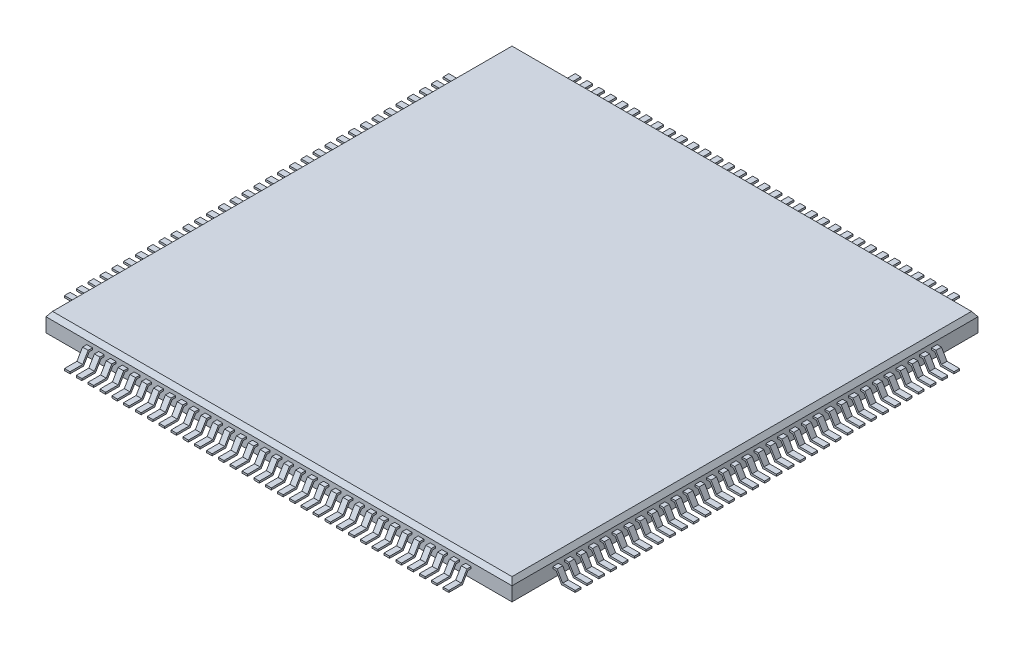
from build123d import *
from OCP.BRepFilletAPI import BRepFilletAPI_MakeChamfer

# Parameters (mm, degrees)
SKETCH1_W             = 25
SKETCH1_H             = 25
EXTRUDE1_DEPTH        = 0.5
CHAMFER1_SIZE         = 0.25
CHAMFER1_SIZE2        = 0.175051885
EXTRUDE_THIN1_DEPTH   = 0.15
LPATTERN1_COUNT       = 17
LPATTERN1_PITCH       = 0.635
LPATTERN1_COL_COUNT   = 17
LPATTERN1_COL_PITCH   = 0.635
MIRROR1_COPY_1_DEPTH  = 0.15
MIRROR1_COPY_2_DEPTH  = 0.15
MIRROR1_COPY_3_DEPTH  = 0.15
MIRROR1_COPY_4_DEPTH  = 0.15
MIRROR1_COPY_5_DEPTH  = 0.15
MIRROR1_COPY_6_DEPTH  = 0.15
MIRROR1_COPY_7_DEPTH  = 0.15
MIRROR1_COPY_8_DEPTH  = 0.15
MIRROR1_COPY_9_DEPTH  = 0.15
MIRROR1_COPY_10_DEPTH = 0.15
MIRROR1_COPY_11_DEPTH = 0.15
MIRROR1_COPY_12_DEPTH = 0.15
MIRROR1_COPY_13_DEPTH = 0.15
MIRROR1_COPY_14_DEPTH = 0.15
MIRROR1_COPY_15_DEPTH = 0.15
MIRROR1_COPY_16_DEPTH = 0.15
MIRROR1_COPY_17_DEPTH = 0.15
MIRROR1_COPY_18_DEPTH = 0.15
MIRROR1_COPY_19_DEPTH = 0.15
MIRROR1_COPY_20_DEPTH = 0.15
MIRROR1_COPY_21_DEPTH = 0.15
MIRROR1_COPY_22_DEPTH = 0.15
MIRROR1_COPY_23_DEPTH = 0.15
MIRROR1_COPY_24_DEPTH = 0.15
MIRROR1_COPY_25_DEPTH = 0.15
MIRROR1_COPY_26_DEPTH = 0.15
MIRROR1_COPY_27_DEPTH = 0.15
MIRROR1_COPY_28_DEPTH = 0.15
MIRROR1_COPY_29_DEPTH = 0.15
MIRROR1_COPY_30_DEPTH = 0.15
MIRROR1_COPY_31_DEPTH = 0.15
MIRROR1_COPY_32_DEPTH = 0.15
BODY_MOVE_COPY1_ANGLE = 90


with BuildPart() as part:
    # Sketch1 → Extrude1 (new, symmetric)
    with BuildSketch(Plane(origin=(0, 0, 0), x_dir=(1, 0, 0), z_dir=(0, 1, 0))):
        Rectangle(SKETCH1_W, SKETCH1_H)
    extrude(amount=EXTRUDE1_DEPTH, both=True)

    # Chamfer1: one chamfer whose edges measure the first distance from different faces: ONE call of the kernel's chamfer builder (chamfer() names one face for all edges)
    chamfer1_edges_1 = [part.edges().sort_by_distance(p)[0] for p in [
        (12.5, 0.5, 0),
    ]]
    chamfer1_side_1 = [part.faces().sort_by_distance(p)[0] for p in [
        (12.5, 0, 0),
    ]]
    chamfer1_edges_2 = [part.edges().sort_by_distance(p)[0] for p in [
        (0, 0.5, -12.5),
    ]]
    chamfer1_side_2 = [part.faces().sort_by_distance(p)[0] for p in [
        (0, 0, -12.5),
    ]]
    chamfer1_edges_3 = [part.edges().sort_by_distance(p)[0] for p in [
        (-12.5, 0.5, 0),
    ]]
    chamfer1_side_3 = [part.faces().sort_by_distance(p)[0] for p in [
        (-12.5, 0, 0),
    ]]
    chamfer1_edges_4 = [part.edges().sort_by_distance(p)[0] for p in [
        (0, 0.5, 12.5),
    ]]
    chamfer1_side_4 = [part.faces().sort_by_distance(p)[0] for p in [
        (0, 0, 12.5),
    ]]
    chamfer1 = BRepFilletAPI_MakeChamfer(part.part.solid().wrapped)
    for e in chamfer1_edges_1:
        chamfer1.Add(CHAMFER1_SIZE, CHAMFER1_SIZE2, e.wrapped, chamfer1_side_1[0].wrapped)  # the first distance lies on this face
    for e in chamfer1_edges_2:
        chamfer1.Add(CHAMFER1_SIZE, CHAMFER1_SIZE2, e.wrapped, chamfer1_side_2[0].wrapped)  # the first distance lies on this face
    for e in chamfer1_edges_3:
        chamfer1.Add(CHAMFER1_SIZE, CHAMFER1_SIZE2, e.wrapped, chamfer1_side_3[0].wrapped)  # the first distance lies on this face
    for e in chamfer1_edges_4:
        chamfer1.Add(CHAMFER1_SIZE, CHAMFER1_SIZE2, e.wrapped, chamfer1_side_4[0].wrapped)  # the first distance lies on this face
    add(Compound.cast(chamfer1.Shape()), mode=Mode.REPLACE)

    # Sketch4 → Extrude-Thin1 (add, symmetric)
    with BuildSketch(Plane.XY):
        Polygon((-12.5, 0.05), (-12.728597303, 0.05), (-13.028597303, -0.46), (-13.7, -0.46), (-13.7, -0.56), (-12.971402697, -0.56), (-12.671402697, -0.05), (-12.5, -0.05), align=None)
    extrude_thin1 = extrude(amount=EXTRUDE_THIN1_DEPTH, both=True)

    # LPattern1: Extrude-Thin1 ×17
    with Locations(*[(0, 0, -i * LPATTERN1_PITCH) for i in range(1, LPATTERN1_COUNT)]):
        add(extrude_thin1)

    # LPattern1 col: Extrude-Thin1 ×17
    with Locations(*[(0, 0, i * LPATTERN1_COL_PITCH) for i in range(1, LPATTERN1_COL_COUNT)]):
        add(extrude_thin1)

    # Mirror1: Extrude-Thin1 across plane
    add(extrude_thin1.mirror(Plane(origin=(0, 0, 0), x_dir=(0, 0, 1), z_dir=(1, 0, 0))))

    # Mirror1 copy 1 sketch → Mirror1 copy 1 (add, symmetric)
    with BuildSketch(Plane(origin=(0, 0, -0.635), x_dir=(-1, 0, 0), z_dir=(0, 0, 1))):
        Polygon((-12.5, -0.05), (-12.728597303, -0.05), (-13.028597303, 0.46), (-13.7, 0.46), (-13.7, 0.56), (-12.971402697, 0.56), (-12.671402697, 0.05), (-12.5, 0.05), align=None)
    extrude(amount=MIRROR1_COPY_1_DEPTH, both=True)

    # Mirror1 copy 2 sketch → Mirror1 copy 2 (add, symmetric)
    with BuildSketch(Plane(origin=(0, 0, -1.27), x_dir=(-1, 0, 0), z_dir=(0, 0, 1))):
        Polygon((-12.5, -0.05), (-12.728597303, -0.05), (-13.028597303, 0.46), (-13.7, 0.46), (-13.7, 0.56), (-12.971402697, 0.56), (-12.671402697, 0.05), (-12.5, 0.05), align=None)
    extrude(amount=MIRROR1_COPY_2_DEPTH, both=True)

    # Mirror1 copy 3 sketch → Mirror1 copy 3 (add, symmetric)
    with BuildSketch(Plane(origin=(0, 0, -1.905), x_dir=(-1, 0, 0), z_dir=(0, 0, 1))):
        Polygon((-12.5, -0.05), (-12.728597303, -0.05), (-13.028597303, 0.46), (-13.7, 0.46), (-13.7, 0.56), (-12.971402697, 0.56), (-12.671402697, 0.05), (-12.5, 0.05), align=None)
    extrude(amount=MIRROR1_COPY_3_DEPTH, both=True)

    # Mirror1 copy 4 sketch → Mirror1 copy 4 (add, symmetric)
    with BuildSketch(Plane(origin=(0, 0, -2.54), x_dir=(-1, 0, 0), z_dir=(0, 0, 1))):
        Polygon((-12.5, -0.05), (-12.728597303, -0.05), (-13.028597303, 0.46), (-13.7, 0.46), (-13.7, 0.56), (-12.971402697, 0.56), (-12.671402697, 0.05), (-12.5, 0.05), align=None)
    extrude(amount=MIRROR1_COPY_4_DEPTH, both=True)

    # Mirror1 copy 5 sketch → Mirror1 copy 5 (add, symmetric)
    with BuildSketch(Plane(origin=(0, 0, -3.175), x_dir=(-1, 0, 0), z_dir=(0, 0, 1))):
        Polygon((-12.5, -0.05), (-12.728597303, -0.05), (-13.028597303, 0.46), (-13.7, 0.46), (-13.7, 0.56), (-12.971402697, 0.56), (-12.671402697, 0.05), (-12.5, 0.05), align=None)
    extrude(amount=MIRROR1_COPY_5_DEPTH, both=True)

    # Mirror1 copy 6 sketch → Mirror1 copy 6 (add, symmetric)
    with BuildSketch(Plane(origin=(0, 0, -3.81), x_dir=(-1, 0, 0), z_dir=(0, 0, 1))):
        Polygon((-12.5, -0.05), (-12.728597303, -0.05), (-13.028597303, 0.46), (-13.7, 0.46), (-13.7, 0.56), (-12.971402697, 0.56), (-12.671402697, 0.05), (-12.5, 0.05), align=None)
    extrude(amount=MIRROR1_COPY_6_DEPTH, both=True)

    # Mirror1 copy 7 sketch → Mirror1 copy 7 (add, symmetric)
    with BuildSketch(Plane(origin=(0, 0, -4.445), x_dir=(-1, 0, 0), z_dir=(0, 0, 1))):
        Polygon((-12.5, -0.05), (-12.728597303, -0.05), (-13.028597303, 0.46), (-13.7, 0.46), (-13.7, 0.56), (-12.971402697, 0.56), (-12.671402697, 0.05), (-12.5, 0.05), align=None)
    extrude(amount=MIRROR1_COPY_7_DEPTH, both=True)

    # Mirror1 copy 8 sketch → Mirror1 copy 8 (add, symmetric)
    with BuildSketch(Plane(origin=(0, 0, -5.08), x_dir=(-1, 0, 0), z_dir=(0, 0, 1))):
        Polygon((-12.5, -0.05), (-12.728597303, -0.05), (-13.028597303, 0.46), (-13.7, 0.46), (-13.7, 0.56), (-12.971402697, 0.56), (-12.671402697, 0.05), (-12.5, 0.05), align=None)
    extrude(amount=MIRROR1_COPY_8_DEPTH, both=True)

    # Mirror1 copy 9 sketch → Mirror1 copy 9 (add, symmetric)
    with BuildSketch(Plane(origin=(0, 0, -5.715), x_dir=(-1, 0, 0), z_dir=(0, 0, 1))):
        Polygon((-12.5, -0.05), (-12.728597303, -0.05), (-13.028597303, 0.46), (-13.7, 0.46), (-13.7, 0.56), (-12.971402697, 0.56), (-12.671402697, 0.05), (-12.5, 0.05), align=None)
    extrude(amount=MIRROR1_COPY_9_DEPTH, both=True)

    # Mirror1 copy 10 sketch → Mirror1 copy 10 (add, symmetric)
    with BuildSketch(Plane(origin=(0, 0, -6.35), x_dir=(-1, 0, 0), z_dir=(0, 0, 1))):
        Polygon((-12.5, -0.05), (-12.728597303, -0.05), (-13.028597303, 0.46), (-13.7, 0.46), (-13.7, 0.56), (-12.971402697, 0.56), (-12.671402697, 0.05), (-12.5, 0.05), align=None)
    extrude(amount=MIRROR1_COPY_10_DEPTH, both=True)

    # Mirror1 copy 11 sketch → Mirror1 copy 11 (add, symmetric)
    with BuildSketch(Plane(origin=(0, 0, -6.985), x_dir=(-1, 0, 0), z_dir=(0, 0, 1))):
        Polygon((-12.5, -0.05), (-12.728597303, -0.05), (-13.028597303, 0.46), (-13.7, 0.46), (-13.7, 0.56), (-12.971402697, 0.56), (-12.671402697, 0.05), (-12.5, 0.05), align=None)
    extrude(amount=MIRROR1_COPY_11_DEPTH, both=True)

    # Mirror1 copy 12 sketch → Mirror1 copy 12 (add, symmetric)
    with BuildSketch(Plane(origin=(0, 0, -7.62), x_dir=(-1, 0, 0), z_dir=(0, 0, 1))):
        Polygon((-12.5, -0.05), (-12.728597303, -0.05), (-13.028597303, 0.46), (-13.7, 0.46), (-13.7, 0.56), (-12.971402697, 0.56), (-12.671402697, 0.05), (-12.5, 0.05), align=None)
    extrude(amount=MIRROR1_COPY_12_DEPTH, both=True)

    # Mirror1 copy 13 sketch → Mirror1 copy 13 (add, symmetric)
    with BuildSketch(Plane(origin=(0, 0, -8.255), x_dir=(-1, 0, 0), z_dir=(0, 0, 1))):
        Polygon((-12.5, -0.05), (-12.728597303, -0.05), (-13.028597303, 0.46), (-13.7, 0.46), (-13.7, 0.56), (-12.971402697, 0.56), (-12.671402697, 0.05), (-12.5, 0.05), align=None)
    extrude(amount=MIRROR1_COPY_13_DEPTH, both=True)

    # Mirror1 copy 14 sketch → Mirror1 copy 14 (add, symmetric)
    with BuildSketch(Plane(origin=(0, 0, -8.89), x_dir=(-1, 0, 0), z_dir=(0, 0, 1))):
        Polygon((-12.5, -0.05), (-12.728597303, -0.05), (-13.028597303, 0.46), (-13.7, 0.46), (-13.7, 0.56), (-12.971402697, 0.56), (-12.671402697, 0.05), (-12.5, 0.05), align=None)
    extrude(amount=MIRROR1_COPY_14_DEPTH, both=True)

    # Mirror1 copy 15 sketch → Mirror1 copy 15 (add, symmetric)
    with BuildSketch(Plane(origin=(0, 0, -9.525), x_dir=(-1, 0, 0), z_dir=(0, 0, 1))):
        Polygon((-12.5, -0.05), (-12.728597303, -0.05), (-13.028597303, 0.46), (-13.7, 0.46), (-13.7, 0.56), (-12.971402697, 0.56), (-12.671402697, 0.05), (-12.5, 0.05), align=None)
    extrude(amount=MIRROR1_COPY_15_DEPTH, both=True)

    # Mirror1 copy 16 sketch → Mirror1 copy 16 (add, symmetric)
    with BuildSketch(Plane(origin=(0, 0, -10.16), x_dir=(-1, 0, 0), z_dir=(0, 0, 1))):
        Polygon((-12.5, -0.05), (-12.728597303, -0.05), (-13.028597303, 0.46), (-13.7, 0.46), (-13.7, 0.56), (-12.971402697, 0.56), (-12.671402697, 0.05), (-12.5, 0.05), align=None)
    extrude(amount=MIRROR1_COPY_16_DEPTH, both=True)

    # Mirror1 copy 17 sketch → Mirror1 copy 17 (add, symmetric)
    with BuildSketch(Plane(origin=(0, 0, 0.635), x_dir=(-1, 0, 0), z_dir=(0, 0, 1))):
        Polygon((-12.5, -0.05), (-12.728597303, -0.05), (-13.028597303, 0.46), (-13.7, 0.46), (-13.7, 0.56), (-12.971402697, 0.56), (-12.671402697, 0.05), (-12.5, 0.05), align=None)
    extrude(amount=MIRROR1_COPY_17_DEPTH, both=True)

    # Mirror1 copy 18 sketch → Mirror1 copy 18 (add, symmetric)
    with BuildSketch(Plane(origin=(0, 0, 1.27), x_dir=(-1, 0, 0), z_dir=(0, 0, 1))):
        Polygon((-12.5, -0.05), (-12.728597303, -0.05), (-13.028597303, 0.46), (-13.7, 0.46), (-13.7, 0.56), (-12.971402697, 0.56), (-12.671402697, 0.05), (-12.5, 0.05), align=None)
    extrude(amount=MIRROR1_COPY_18_DEPTH, both=True)

    # Mirror1 copy 19 sketch → Mirror1 copy 19 (add, symmetric)
    with BuildSketch(Plane(origin=(0, 0, 1.905), x_dir=(-1, 0, 0), z_dir=(0, 0, 1))):
        Polygon((-12.5, -0.05), (-12.728597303, -0.05), (-13.028597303, 0.46), (-13.7, 0.46), (-13.7, 0.56), (-12.971402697, 0.56), (-12.671402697, 0.05), (-12.5, 0.05), align=None)
    extrude(amount=MIRROR1_COPY_19_DEPTH, both=True)

    # Mirror1 copy 20 sketch → Mirror1 copy 20 (add, symmetric)
    with BuildSketch(Plane(origin=(0, 0, 2.54), x_dir=(-1, 0, 0), z_dir=(0, 0, 1))):
        Polygon((-12.5, -0.05), (-12.728597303, -0.05), (-13.028597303, 0.46), (-13.7, 0.46), (-13.7, 0.56), (-12.971402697, 0.56), (-12.671402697, 0.05), (-12.5, 0.05), align=None)
    extrude(amount=MIRROR1_COPY_20_DEPTH, both=True)

    # Mirror1 copy 21 sketch → Mirror1 copy 21 (add, symmetric)
    with BuildSketch(Plane(origin=(0, 0, 3.175), x_dir=(-1, 0, 0), z_dir=(0, 0, 1))):
        Polygon((-12.5, -0.05), (-12.728597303, -0.05), (-13.028597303, 0.46), (-13.7, 0.46), (-13.7, 0.56), (-12.971402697, 0.56), (-12.671402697, 0.05), (-12.5, 0.05), align=None)
    extrude(amount=MIRROR1_COPY_21_DEPTH, both=True)

    # Mirror1 copy 22 sketch → Mirror1 copy 22 (add, symmetric)
    with BuildSketch(Plane(origin=(0, 0, 3.81), x_dir=(-1, 0, 0), z_dir=(0, 0, 1))):
        Polygon((-12.5, -0.05), (-12.728597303, -0.05), (-13.028597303, 0.46), (-13.7, 0.46), (-13.7, 0.56), (-12.971402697, 0.56), (-12.671402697, 0.05), (-12.5, 0.05), align=None)
    extrude(amount=MIRROR1_COPY_22_DEPTH, both=True)

    # Mirror1 copy 23 sketch → Mirror1 copy 23 (add, symmetric)
    with BuildSketch(Plane(origin=(0, 0, 4.445), x_dir=(-1, 0, 0), z_dir=(0, 0, 1))):
        Polygon((-12.5, -0.05), (-12.728597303, -0.05), (-13.028597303, 0.46), (-13.7, 0.46), (-13.7, 0.56), (-12.971402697, 0.56), (-12.671402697, 0.05), (-12.5, 0.05), align=None)
    extrude(amount=MIRROR1_COPY_23_DEPTH, both=True)

    # Mirror1 copy 24 sketch → Mirror1 copy 24 (add, symmetric)
    with BuildSketch(Plane(origin=(0, 0, 5.08), x_dir=(-1, 0, 0), z_dir=(0, 0, 1))):
        Polygon((-12.5, -0.05), (-12.728597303, -0.05), (-13.028597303, 0.46), (-13.7, 0.46), (-13.7, 0.56), (-12.971402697, 0.56), (-12.671402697, 0.05), (-12.5, 0.05), align=None)
    extrude(amount=MIRROR1_COPY_24_DEPTH, both=True)

    # Mirror1 copy 25 sketch → Mirror1 copy 25 (add, symmetric)
    with BuildSketch(Plane(origin=(0, 0, 5.715), x_dir=(-1, 0, 0), z_dir=(0, 0, 1))):
        Polygon((-12.5, -0.05), (-12.728597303, -0.05), (-13.028597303, 0.46), (-13.7, 0.46), (-13.7, 0.56), (-12.971402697, 0.56), (-12.671402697, 0.05), (-12.5, 0.05), align=None)
    extrude(amount=MIRROR1_COPY_25_DEPTH, both=True)

    # Mirror1 copy 26 sketch → Mirror1 copy 26 (add, symmetric)
    with BuildSketch(Plane(origin=(0, 0, 6.35), x_dir=(-1, 0, 0), z_dir=(0, 0, 1))):
        Polygon((-12.5, -0.05), (-12.728597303, -0.05), (-13.028597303, 0.46), (-13.7, 0.46), (-13.7, 0.56), (-12.971402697, 0.56), (-12.671402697, 0.05), (-12.5, 0.05), align=None)
    extrude(amount=MIRROR1_COPY_26_DEPTH, both=True)

    # Mirror1 copy 27 sketch → Mirror1 copy 27 (add, symmetric)
    with BuildSketch(Plane(origin=(0, 0, 6.985), x_dir=(-1, 0, 0), z_dir=(0, 0, 1))):
        Polygon((-12.5, -0.05), (-12.728597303, -0.05), (-13.028597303, 0.46), (-13.7, 0.46), (-13.7, 0.56), (-12.971402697, 0.56), (-12.671402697, 0.05), (-12.5, 0.05), align=None)
    extrude(amount=MIRROR1_COPY_27_DEPTH, both=True)

    # Mirror1 copy 28 sketch → Mirror1 copy 28 (add, symmetric)
    with BuildSketch(Plane(origin=(0, 0, 7.62), x_dir=(-1, 0, 0), z_dir=(0, 0, 1))):
        Polygon((-12.5, -0.05), (-12.728597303, -0.05), (-13.028597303, 0.46), (-13.7, 0.46), (-13.7, 0.56), (-12.971402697, 0.56), (-12.671402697, 0.05), (-12.5, 0.05), align=None)
    extrude(amount=MIRROR1_COPY_28_DEPTH, both=True)

    # Mirror1 copy 29 sketch → Mirror1 copy 29 (add, symmetric)
    with BuildSketch(Plane(origin=(0, 0, 8.255), x_dir=(-1, 0, 0), z_dir=(0, 0, 1))):
        Polygon((-12.5, -0.05), (-12.728597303, -0.05), (-13.028597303, 0.46), (-13.7, 0.46), (-13.7, 0.56), (-12.971402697, 0.56), (-12.671402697, 0.05), (-12.5, 0.05), align=None)
    extrude(amount=MIRROR1_COPY_29_DEPTH, both=True)

    # Mirror1 copy 30 sketch → Mirror1 copy 30 (add, symmetric)
    with BuildSketch(Plane(origin=(0, 0, 8.89), x_dir=(-1, 0, 0), z_dir=(0, 0, 1))):
        Polygon((-12.5, -0.05), (-12.728597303, -0.05), (-13.028597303, 0.46), (-13.7, 0.46), (-13.7, 0.56), (-12.971402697, 0.56), (-12.671402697, 0.05), (-12.5, 0.05), align=None)
    extrude(amount=MIRROR1_COPY_30_DEPTH, both=True)

    # Mirror1 copy 31 sketch → Mirror1 copy 31 (add, symmetric)
    with BuildSketch(Plane(origin=(0, 0, 9.525), x_dir=(-1, 0, 0), z_dir=(0, 0, 1))):
        Polygon((-12.5, -0.05), (-12.728597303, -0.05), (-13.028597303, 0.46), (-13.7, 0.46), (-13.7, 0.56), (-12.971402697, 0.56), (-12.671402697, 0.05), (-12.5, 0.05), align=None)
    extrude(amount=MIRROR1_COPY_31_DEPTH, both=True)

    # Mirror1 copy 32 sketch → Mirror1 copy 32 (add, symmetric)
    with BuildSketch(Plane(origin=(0, 0, 10.16), x_dir=(-1, 0, 0), z_dir=(0, 0, 1))):
        Polygon((-12.5, -0.05), (-12.728597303, -0.05), (-13.028597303, 0.46), (-13.7, 0.46), (-13.7, 0.56), (-12.971402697, 0.56), (-12.671402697, 0.05), (-12.5, 0.05), align=None)
    extrude(amount=MIRROR1_COPY_32_DEPTH, both=True)


with BuildPart() as body_2:
    # Body-Move_Copy1: copy of part
    add(part.part.rotate(Axis((0, 0, 0), (0, 1, 0)), BODY_MOVE_COPY1_ANGLE))


with BuildPart() as part_1:
    add(part.part)

    # Combine1: union body 2
    add(body_2.part)


solid = part_1.part
